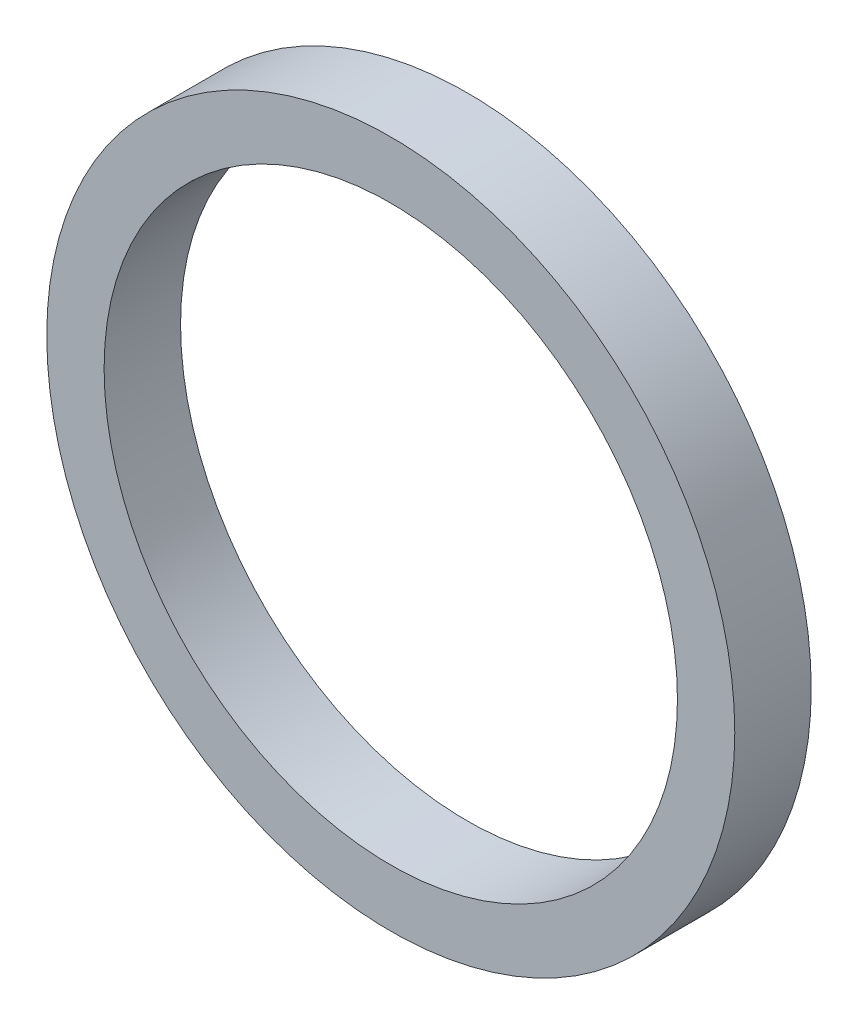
ISO-10303-21;
HEADER;
FILE_DESCRIPTION(('STEP AP214'),'2;1');
FILE_NAME('part.step','',(''),(''),'','','');
FILE_SCHEMA(('AUTOMOTIVE_DESIGN { 1 0 10303 214 1 1 1 1 }'));
ENDSEC;
DATA;
#1=APPLICATION_CONTEXT('core data for automotive mechanical design processes');
#2=APPLICATION_PROTOCOL_DEFINITION('international standard','automotive_design',2000,#1);
#3=PRODUCT_CONTEXT('',#1,'mechanical');
#4=PRODUCT('Part','Part','',(#3));
#5=PRODUCT_RELATED_PRODUCT_CATEGORY('part','',(#4));
#6=PRODUCT_DEFINITION_FORMATION('','',#4);
#7=PRODUCT_DEFINITION_CONTEXT('part definition',#1,'design');
#8=PRODUCT_DEFINITION('design','',#6,#7);
#9=PRODUCT_DEFINITION_SHAPE('','',#8);
#10=(LENGTH_UNIT() NAMED_UNIT(*) SI_UNIT(.MILLI.,.METRE.));
#11=(NAMED_UNIT(*) PLANE_ANGLE_UNIT() SI_UNIT($,.RADIAN.));
#12=(NAMED_UNIT(*) SI_UNIT($,.STERADIAN.) SOLID_ANGLE_UNIT());
#13=UNCERTAINTY_MEASURE_WITH_UNIT(LENGTH_MEASURE(1.E-05),#10,'distance_accuracy_value','');
#14=(GEOMETRIC_REPRESENTATION_CONTEXT(3) GLOBAL_UNCERTAINTY_ASSIGNED_CONTEXT((#13)) GLOBAL_UNIT_ASSIGNED_CONTEXT((#10,
#11,#12)) REPRESENTATION_CONTEXT('',''));
#15=CARTESIAN_POINT('',(0.,0.,0.));
#16=DIRECTION('',(0.,0.,1.));
#17=DIRECTION('',(1.,0.,0.));
#18=AXIS2_PLACEMENT_3D('',#15,#16,#17);
#19=CARTESIAN_POINT('',(0.,0.,-4.));
#20=DIRECTION('',(0.,0.,1.));
#21=DIRECTION('',(1.,0.,0.));
#22=AXIS2_PLACEMENT_3D('',#19,#20,#21);
#23=CYLINDRICAL_SURFACE('',#22,18.);
#24=CARTESIAN_POINT('',(0.,0.,-4.));
#25=DIRECTION('',(0.,0.,1.));
#26=DIRECTION('',(1.,0.,0.));
#27=AXIS2_PLACEMENT_3D('',#24,#25,#26);
#28=CIRCLE('',#27,18.);
#29=CARTESIAN_POINT('',(18.,0.,-4.));
#30=VERTEX_POINT('',#29);
#31=EDGE_CURVE('E10',#30,#30,#28,.T.);
#32=ORIENTED_EDGE('',*,*,#31,.T.);
#33=EDGE_LOOP('',(#32));
#34=FACE_BOUND('',#33,.T.);
#35=CARTESIAN_POINT('',(0.,0.,0.));
#36=DIRECTION('',(0.,0.,1.));
#37=DIRECTION('',(1.,0.,0.));
#38=AXIS2_PLACEMENT_3D('',#35,#36,#37);
#39=CIRCLE('',#38,18.);
#40=CARTESIAN_POINT('',(18.,0.,0.));
#41=VERTEX_POINT('',#40);
#42=EDGE_CURVE('E40',#41,#41,#39,.T.);
#43=ORIENTED_EDGE('',*,*,#42,.F.);
#44=EDGE_LOOP('',(#43));
#45=FACE_BOUND('',#44,.T.);
#46=ADVANCED_FACE('F37',(#34,#45),#23,.T.);
#47=CARTESIAN_POINT('',(0.,0.,-4.));
#48=DIRECTION('',(0.,0.,1.));
#49=DIRECTION('',(1.,0.,0.));
#50=AXIS2_PLACEMENT_3D('',#47,#48,#49);
#51=PLANE('',#50);
#52=CARTESIAN_POINT('',(0.,0.,-4.));
#53=DIRECTION('',(0.,0.,1.));
#54=DIRECTION('',(1.,0.,0.));
#55=AXIS2_PLACEMENT_3D('',#52,#53,#54);
#56=CIRCLE('',#55,15.);
#57=CARTESIAN_POINT('',(15.,0.,-4.));
#58=VERTEX_POINT('',#57);
#59=EDGE_CURVE('E47',#58,#58,#56,.T.);
#60=ORIENTED_EDGE('',*,*,#59,.T.);
#61=EDGE_LOOP('',(#60));
#62=FACE_BOUND('',#61,.T.);
#63=ORIENTED_EDGE('',*,*,#31,.F.);
#64=EDGE_LOOP('',(#63));
#65=FACE_BOUND('',#64,.T.);
#66=ADVANCED_FACE('F55',(#62,#65),#51,.F.);
#67=CARTESIAN_POINT('',(0.,0.,0.));
#68=DIRECTION('',(0.,0.,1.));
#69=DIRECTION('',(1.,0.,0.));
#70=AXIS2_PLACEMENT_3D('',#67,#68,#69);
#71=PLANE('',#70);
#72=CARTESIAN_POINT('',(0.,0.,0.));
#73=DIRECTION('',(0.,0.,1.));
#74=DIRECTION('',(1.,0.,0.));
#75=AXIS2_PLACEMENT_3D('',#72,#73,#74);
#76=CIRCLE('',#75,15.);
#77=CARTESIAN_POINT('',(15.,0.,0.));
#78=VERTEX_POINT('',#77);
#79=EDGE_CURVE('E49',#78,#78,#76,.T.);
#80=ORIENTED_EDGE('',*,*,#79,.F.);
#81=EDGE_LOOP('',(#80));
#82=FACE_BOUND('',#81,.T.);
#83=ORIENTED_EDGE('',*,*,#42,.T.);
#84=EDGE_LOOP('',(#83));
#85=FACE_BOUND('',#84,.T.);
#86=ADVANCED_FACE('F61',(#82,#85),#71,.T.);
#87=CARTESIAN_POINT('',(0.,0.,-4.));
#88=DIRECTION('',(0.,0.,1.));
#89=DIRECTION('',(1.,0.,0.));
#90=AXIS2_PLACEMENT_3D('',#87,#88,#89);
#91=CYLINDRICAL_SURFACE('',#90,15.);
#92=ORIENTED_EDGE('',*,*,#59,.F.);
#93=EDGE_LOOP('',(#92));
#94=FACE_BOUND('',#93,.T.);
#95=ORIENTED_EDGE('',*,*,#79,.T.);
#96=EDGE_LOOP('',(#95));
#97=FACE_BOUND('',#96,.T.);
#98=ADVANCED_FACE('F58',(#94,#97),#91,.F.);
#99=CLOSED_SHELL('',(#46,#66,#86,#98));
#100=MANIFOLD_SOLID_BREP('B2',#99);
#101=ADVANCED_BREP_SHAPE_REPRESENTATION('',(#18,#100),#14);
#102=SHAPE_DEFINITION_REPRESENTATION(#9,#101);
ENDSEC;
END-ISO-10303-21;
